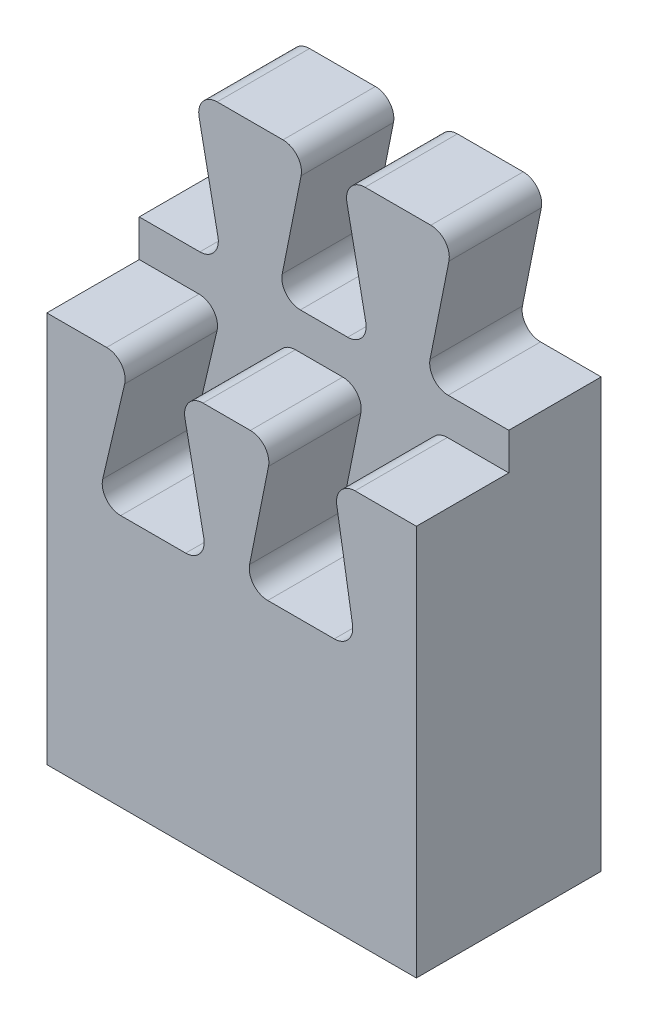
ISO-10303-21;
HEADER;
FILE_DESCRIPTION(('STEP AP214'),'2;1');
FILE_NAME('part.step','',(''),(''),'','','');
FILE_SCHEMA(('AUTOMOTIVE_DESIGN { 1 0 10303 214 1 1 1 1 }'));
ENDSEC;
DATA;
#1=APPLICATION_CONTEXT('core data for automotive mechanical design processes');
#2=APPLICATION_PROTOCOL_DEFINITION('international standard','automotive_design',2000,#1);
#3=PRODUCT_CONTEXT('',#1,'mechanical');
#4=PRODUCT('Part','Part','',(#3));
#5=PRODUCT_RELATED_PRODUCT_CATEGORY('part','',(#4));
#6=PRODUCT_DEFINITION_FORMATION('','',#4);
#7=PRODUCT_DEFINITION_CONTEXT('part definition',#1,'design');
#8=PRODUCT_DEFINITION('design','',#6,#7);
#9=PRODUCT_DEFINITION_SHAPE('','',#8);
#10=(LENGTH_UNIT() NAMED_UNIT(*) SI_UNIT(.MILLI.,.METRE.));
#11=(NAMED_UNIT(*) PLANE_ANGLE_UNIT() SI_UNIT($,.RADIAN.));
#12=(NAMED_UNIT(*) SI_UNIT($,.STERADIAN.) SOLID_ANGLE_UNIT());
#13=UNCERTAINTY_MEASURE_WITH_UNIT(LENGTH_MEASURE(1.E-05),#10,'distance_accuracy_value','');
#14=(GEOMETRIC_REPRESENTATION_CONTEXT(3) GLOBAL_UNCERTAINTY_ASSIGNED_CONTEXT((#13)) GLOBAL_UNIT_ASSIGNED_CONTEXT((#10,
#11,#12)) REPRESENTATION_CONTEXT('',''));
#15=CARTESIAN_POINT('',(0.,0.,0.));
#16=DIRECTION('',(0.,0.,1.));
#17=DIRECTION('',(1.,0.,0.));
#18=AXIS2_PLACEMENT_3D('',#15,#16,#17);
#19=CARTESIAN_POINT('',(2.76607840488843,36.6112155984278,5.));
#20=DIRECTION('',(-0.98058067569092,-0.196116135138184,0.));
#21=DIRECTION('',(0.196116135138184,-0.98058067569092,0.));
#22=AXIS2_PLACEMENT_3D('',#19,#20,#21);
#23=PLANE('',#22);
#24=DIRECTION('',(-0.196116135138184,0.98058067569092,0.));
#25=VECTOR('',#24,1.);
#26=CARTESIAN_POINT('',(2.76607840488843,36.6112155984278,0.));
#27=LINE('',#26,#25);
#28=CARTESIAN_POINT('',(2.5268551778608,37.8073317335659,0.));
#29=VERTEX_POINT('',#28);
#30=CARTESIAN_POINT('',(1.50530163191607,42.9150994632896,0.));
#31=VERTEX_POINT('',#30);
#32=EDGE_CURVE('E310',#29,#31,#27,.T.);
#33=ORIENTED_EDGE('',*,*,#32,.F.);
#34=DIRECTION('',(0.,0.,-1.));
#35=VECTOR('',#34,1.);
#36=CARTESIAN_POINT('',(2.5268551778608,37.8073317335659,5.));
#37=LINE('',#36,#35);
#38=CARTESIAN_POINT('',(2.5268551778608,37.8073317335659,5.));
#39=VERTEX_POINT('',#38);
#40=EDGE_CURVE('E518',#29,#39,#37,.F.);
#41=ORIENTED_EDGE('',*,*,#40,.T.);
#42=DIRECTION('',(-0.196116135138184,0.98058067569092,0.));
#43=VECTOR('',#42,1.);
#44=CARTESIAN_POINT('',(2.76607840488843,36.6112155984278,5.));
#45=LINE('',#44,#43);
#46=CARTESIAN_POINT('',(1.50530163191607,42.9150994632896,5.));
#47=VERTEX_POINT('',#46);
#48=EDGE_CURVE('E338',#39,#47,#45,.T.);
#49=ORIENTED_EDGE('',*,*,#48,.T.);
#50=DIRECTION('',(0.,0.,-1.));
#51=VECTOR('',#50,1.);
#52=CARTESIAN_POINT('',(1.50530163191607,42.9150994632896,5.));
#53=LINE('',#52,#51);
#54=EDGE_CURVE('E522',#47,#31,#53,.T.);
#55=ORIENTED_EDGE('',*,*,#54,.T.);
#56=EDGE_LOOP('',(#33,#41,#49,#55));
#57=FACE_BOUND('',#56,.T.);
#58=ADVANCED_FACE('F33',(#57),#23,.T.);
#59=CARTESIAN_POINT('',(-1.73392159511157,36.6112155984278,5.));
#60=DIRECTION('',(0.,1.,0.));
#61=DIRECTION('',(0.,0.,1.));
#62=AXIS2_PLACEMENT_3D('',#59,#60,#61);
#63=PLANE('',#62);
#64=DIRECTION('',(1.,0.,0.));
#65=VECTOR('',#64,1.);
#66=CARTESIAN_POINT('',(-1.73392159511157,36.6112155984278,5.));
#67=LINE('',#66,#65);
#68=CARTESIAN_POINT('',(-1.73392159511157,36.6112155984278,5.));
#69=VERTEX_POINT('',#68);
#70=CARTESIAN_POINT('',(1.54627450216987,36.6112155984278,5.));
#71=VERTEX_POINT('',#70);
#72=EDGE_CURVE('E591',#69,#71,#67,.T.);
#73=ORIENTED_EDGE('',*,*,#72,.T.);
#74=DIRECTION('',(0.,0.,-1.));
#75=VECTOR('',#74,1.);
#76=CARTESIAN_POINT('',(1.54627450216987,36.6112155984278,0.));
#77=LINE('',#76,#75);
#78=CARTESIAN_POINT('',(1.54627450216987,36.6112155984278,0.));
#79=VERTEX_POINT('',#78);
#80=EDGE_CURVE('E575',#71,#79,#77,.T.);
#81=ORIENTED_EDGE('',*,*,#80,.T.);
#82=DIRECTION('',(1.,0.,0.));
#83=VECTOR('',#82,1.);
#84=CARTESIAN_POINT('',(-1.73392159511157,36.6112155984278,0.));
#85=LINE('',#84,#83);
#86=CARTESIAN_POINT('',(-1.73392159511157,36.6112155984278,0.));
#87=VERTEX_POINT('',#86);
#88=EDGE_CURVE('E342',#87,#79,#85,.T.);
#89=ORIENTED_EDGE('',*,*,#88,.F.);
#90=DIRECTION('',(0.,0.,-1.));
#91=VECTOR('',#90,1.);
#92=CARTESIAN_POINT('',(-1.73392159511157,36.6112155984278,5.));
#93=LINE('',#92,#91);
#94=EDGE_CURVE('E324',#69,#87,#93,.T.);
#95=ORIENTED_EDGE('',*,*,#94,.F.);
#96=EDGE_LOOP('',(#73,#81,#89,#95));
#97=FACE_BOUND('',#96,.T.);
#98=ADVANCED_FACE('F695',(#97),#63,.T.);
#99=CARTESIAN_POINT('',(-1.73392159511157,36.6112155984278,5.));
#100=DIRECTION('',(1.,0.,0.));
#101=DIRECTION('',(0.,0.,-1.));
#102=AXIS2_PLACEMENT_3D('',#99,#100,#101);
#103=PLANE('',#102);
#104=DIRECTION('',(0.,-1.,0.));
#105=VECTOR('',#104,1.);
#106=CARTESIAN_POINT('',(-1.73392159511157,36.6112155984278,0.));
#107=LINE('',#106,#105);
#108=CARTESIAN_POINT('',(-1.73392159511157,13.4394595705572,0.));
#109=VERTEX_POINT('',#108);
#110=EDGE_CURVE('E607',#87,#109,#107,.T.);
#111=ORIENTED_EDGE('',*,*,#110,.T.);
#112=DIRECTION('',(0.,0.,-1.));
#113=VECTOR('',#112,1.);
#114=CARTESIAN_POINT('',(-1.73392159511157,13.4394595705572,5.));
#115=LINE('',#114,#113);
#116=CARTESIAN_POINT('',(-1.73392159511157,13.4394595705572,10.));
#117=VERTEX_POINT('',#116);
#118=EDGE_CURVE('E611',#117,#109,#115,.T.);
#119=ORIENTED_EDGE('',*,*,#118,.F.);
#120=DIRECTION('',(0.,-1.,0.));
#121=VECTOR('',#120,1.);
#122=CARTESIAN_POINT('',(-1.73392159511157,34.6112155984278,10.));
#123=LINE('',#122,#121);
#124=CARTESIAN_POINT('',(-1.73392159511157,34.6112155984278,10.));
#125=VERTEX_POINT('',#124);
#126=EDGE_CURVE('E313',#125,#117,#123,.T.);
#127=ORIENTED_EDGE('',*,*,#126,.F.);
#128=DIRECTION('',(0.,0.,-1.));
#129=VECTOR('',#128,1.);
#130=CARTESIAN_POINT('',(-1.73392159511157,34.6112155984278,10.));
#131=LINE('',#130,#129);
#132=CARTESIAN_POINT('',(-1.73392159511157,34.6112155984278,5.));
#133=VERTEX_POINT('',#132);
#134=EDGE_CURVE('E307',#125,#133,#131,.T.);
#135=ORIENTED_EDGE('',*,*,#134,.T.);
#136=DIRECTION('',(0.,-1.,0.));
#137=VECTOR('',#136,1.);
#138=CARTESIAN_POINT('',(-1.73392159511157,36.6112155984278,5.));
#139=LINE('',#138,#137);
#140=EDGE_CURVE('E368',#69,#133,#139,.T.);
#141=ORIENTED_EDGE('',*,*,#140,.F.);
#142=ORIENTED_EDGE('',*,*,#94,.T.);
#143=EDGE_LOOP('',(#111,#119,#127,#135,#141,#142));
#144=FACE_BOUND('',#143,.T.);
#145=ADVANCED_FACE('F625',(#144),#103,.F.);
#146=CARTESIAN_POINT('',(-1.73392159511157,13.4394595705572,5.));
#147=DIRECTION('',(0.,1.,0.));
#148=DIRECTION('',(0.,0.,1.));
#149=AXIS2_PLACEMENT_3D('',#146,#147,#148);
#150=PLANE('',#149);
#151=DIRECTION('',(1.,0.,0.));
#152=VECTOR('',#151,1.);
#153=CARTESIAN_POINT('',(-1.73392159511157,13.4394595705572,0.));
#154=LINE('',#153,#152);
#155=CARTESIAN_POINT('',(18.2660784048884,13.4394595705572,0.));
#156=VERTEX_POINT('',#155);
#157=EDGE_CURVE('E605',#109,#156,#154,.T.);
#158=ORIENTED_EDGE('',*,*,#157,.T.);
#159=DIRECTION('',(0.,0.,-1.));
#160=VECTOR('',#159,1.);
#161=CARTESIAN_POINT('',(18.2660784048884,13.4394595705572,5.));
#162=LINE('',#161,#160);
#163=CARTESIAN_POINT('',(18.2660784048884,13.4394595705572,10.));
#164=VERTEX_POINT('',#163);
#165=EDGE_CURVE('E614',#164,#156,#162,.T.);
#166=ORIENTED_EDGE('',*,*,#165,.F.);
#167=DIRECTION('',(1.,0.,0.));
#168=VECTOR('',#167,1.);
#169=CARTESIAN_POINT('',(-1.73392159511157,13.4394595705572,10.));
#170=LINE('',#169,#168);
#171=EDGE_CURVE('E298',#117,#164,#170,.T.);
#172=ORIENTED_EDGE('',*,*,#171,.F.);
#173=ORIENTED_EDGE('',*,*,#118,.T.);
#174=EDGE_LOOP('',(#158,#166,#172,#173));
#175=FACE_BOUND('',#174,.T.);
#176=ADVANCED_FACE('F1011',(#175),#150,.F.);
#177=CARTESIAN_POINT('',(18.2660784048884,13.4394595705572,5.));
#178=DIRECTION('',(-1.,0.,0.));
#179=DIRECTION('',(0.,0.,1.));
#180=AXIS2_PLACEMENT_3D('',#177,#178,#179);
#181=PLANE('',#180);
#182=DIRECTION('',(0.,1.,0.));
#183=VECTOR('',#182,1.);
#184=CARTESIAN_POINT('',(18.2660784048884,13.4394595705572,0.));
#185=LINE('',#184,#183);
#186=CARTESIAN_POINT('',(18.2660784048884,36.6112155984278,0.));
#187=VERTEX_POINT('',#186);
#188=EDGE_CURVE('E603',#156,#187,#185,.T.);
#189=ORIENTED_EDGE('',*,*,#188,.T.);
#190=DIRECTION('',(0.,0.,-1.));
#191=VECTOR('',#190,1.);
#192=CARTESIAN_POINT('',(18.2660784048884,36.6112155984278,5.));
#193=LINE('',#192,#191);
#194=CARTESIAN_POINT('',(18.2660784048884,36.6112155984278,5.));
#195=VERTEX_POINT('',#194);
#196=EDGE_CURVE('E615',#195,#187,#193,.T.);
#197=ORIENTED_EDGE('',*,*,#196,.F.);
#198=DIRECTION('',(0.,1.,0.));
#199=VECTOR('',#198,1.);
#200=CARTESIAN_POINT('',(18.2660784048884,13.4394595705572,5.));
#201=LINE('',#200,#199);
#202=CARTESIAN_POINT('',(18.2660784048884,34.6112155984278,5.));
#203=VERTEX_POINT('',#202);
#204=EDGE_CURVE('E306',#203,#195,#201,.T.);
#205=ORIENTED_EDGE('',*,*,#204,.F.);
#206=DIRECTION('',(0.,0.,-1.));
#207=VECTOR('',#206,1.);
#208=CARTESIAN_POINT('',(18.2660784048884,34.6112155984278,10.));
#209=LINE('',#208,#207);
#210=CARTESIAN_POINT('',(18.2660784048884,34.6112155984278,10.));
#211=VERTEX_POINT('',#210);
#212=EDGE_CURVE('E283',#211,#203,#209,.T.);
#213=ORIENTED_EDGE('',*,*,#212,.F.);
#214=DIRECTION('',(0.,1.,0.));
#215=VECTOR('',#214,1.);
#216=CARTESIAN_POINT('',(18.2660784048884,13.4394595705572,10.));
#217=LINE('',#216,#215);
#218=EDGE_CURVE('E289',#164,#211,#217,.T.);
#219=ORIENTED_EDGE('',*,*,#218,.F.);
#220=ORIENTED_EDGE('',*,*,#165,.T.);
#221=EDGE_LOOP('',(#189,#197,#205,#213,#219,#220));
#222=FACE_BOUND('',#221,.T.);
#223=ADVANCED_FACE('F303',(#222),#181,.F.);
#224=CARTESIAN_POINT('',(13.7660784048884,36.6112155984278,5.));
#225=DIRECTION('',(0.,1.,0.));
#226=DIRECTION('',(0.,0.,1.));
#227=AXIS2_PLACEMENT_3D('',#224,#225,#226);
#228=PLANE('',#227);
#229=DIRECTION('',(1.,0.,0.));
#230=VECTOR('',#229,1.);
#231=CARTESIAN_POINT('',(13.7660784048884,36.6112155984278,0.));
#232=LINE('',#231,#230);
#233=CARTESIAN_POINT('',(14.985882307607,36.6112155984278,0.));
#234=VERTEX_POINT('',#233);
#235=EDGE_CURVE('E601',#234,#187,#232,.T.);
#236=ORIENTED_EDGE('',*,*,#235,.F.);
#237=DIRECTION('',(0.,0.,-1.));
#238=VECTOR('',#237,1.);
#239=CARTESIAN_POINT('',(14.985882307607,36.6112155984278,5.));
#240=LINE('',#239,#238);
#241=CARTESIAN_POINT('',(14.985882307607,36.6112155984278,5.));
#242=VERTEX_POINT('',#241);
#243=EDGE_CURVE('E454',#234,#242,#240,.F.);
#244=ORIENTED_EDGE('',*,*,#243,.T.);
#245=DIRECTION('',(1.,0.,0.));
#246=VECTOR('',#245,1.);
#247=CARTESIAN_POINT('',(13.7660784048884,36.6112155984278,5.));
#248=LINE('',#247,#246);
#249=EDGE_CURVE('E360',#242,#195,#248,.T.);
#250=ORIENTED_EDGE('',*,*,#249,.T.);
#251=ORIENTED_EDGE('',*,*,#196,.T.);
#252=EDGE_LOOP('',(#236,#244,#250,#251));
#253=FACE_BOUND('',#252,.T.);
#254=ADVANCED_FACE('F981',(#253),#228,.T.);
#255=CARTESIAN_POINT('',(15.2660784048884,44.1112155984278,5.));
#256=DIRECTION('',(0.98058067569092,-0.196116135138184,0.));
#257=DIRECTION('',(0.196116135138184,0.98058067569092,0.));
#258=AXIS2_PLACEMENT_3D('',#255,#256,#257);
#259=PLANE('',#258);
#260=DIRECTION('',(-0.196116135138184,-0.98058067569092,0.));
#261=VECTOR('',#260,1.);
#262=CARTESIAN_POINT('',(15.2660784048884,44.1112155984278,5.));
#263=LINE('',#262,#261);
#264=CARTESIAN_POINT('',(15.0268551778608,42.9150994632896,5.));
#265=VERTEX_POINT('',#264);
#266=CARTESIAN_POINT('',(14.0053016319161,37.8073317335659,5.));
#267=VERTEX_POINT('',#266);
#268=EDGE_CURVE('E357',#265,#267,#263,.T.);
#269=ORIENTED_EDGE('',*,*,#268,.T.);
#270=DIRECTION('',(0.,0.,-1.));
#271=VECTOR('',#270,1.);
#272=CARTESIAN_POINT('',(14.0053016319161,37.8073317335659,0.));
#273=LINE('',#272,#271);
#274=CARTESIAN_POINT('',(14.0053016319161,37.8073317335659,0.));
#275=VERTEX_POINT('',#274);
#276=EDGE_CURVE('E451',#267,#275,#273,.T.);
#277=ORIENTED_EDGE('',*,*,#276,.T.);
#278=DIRECTION('',(-0.196116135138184,-0.98058067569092,0.));
#279=VECTOR('',#278,1.);
#280=CARTESIAN_POINT('',(15.2660784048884,44.1112155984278,0.));
#281=LINE('',#280,#279);
#282=CARTESIAN_POINT('',(15.0268551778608,42.9150994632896,0.));
#283=VERTEX_POINT('',#282);
#284=EDGE_CURVE('E598',#283,#275,#281,.T.);
#285=ORIENTED_EDGE('',*,*,#284,.F.);
#286=DIRECTION('',(0.,0.,-1.));
#287=VECTOR('',#286,1.);
#288=CARTESIAN_POINT('',(15.0268551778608,42.9150994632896,5.));
#289=LINE('',#288,#287);
#290=EDGE_CURVE('E449',#283,#265,#289,.F.);
#291=ORIENTED_EDGE('',*,*,#290,.T.);
#292=EDGE_LOOP('',(#269,#277,#285,#291));
#293=FACE_BOUND('',#292,.T.);
#294=ADVANCED_FACE('F971',(#293),#259,.T.);
#295=CARTESIAN_POINT('',(9.26607840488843,44.1112155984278,5.));
#296=DIRECTION('',(0.,1.,0.));
#297=DIRECTION('',(0.,0.,1.));
#298=AXIS2_PLACEMENT_3D('',#295,#296,#297);
#299=PLANE('',#298);
#300=DIRECTION('',(1.,0.,0.));
#301=VECTOR('',#300,1.);
#302=CARTESIAN_POINT('',(9.26607840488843,44.1112155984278,5.));
#303=LINE('',#302,#301);
#304=CARTESIAN_POINT('',(10.485882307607,44.1112155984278,5.));
#305=VERTEX_POINT('',#304);
#306=CARTESIAN_POINT('',(14.0462745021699,44.1112155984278,5.));
#307=VERTEX_POINT('',#306);
#308=EDGE_CURVE('E354',#305,#307,#303,.T.);
#309=ORIENTED_EDGE('',*,*,#308,.T.);
#310=DIRECTION('',(0.,0.,-1.));
#311=VECTOR('',#310,1.);
#312=CARTESIAN_POINT('',(14.0462745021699,44.1112155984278,5.));
#313=LINE('',#312,#311);
#314=CARTESIAN_POINT('',(14.0462745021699,44.1112155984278,0.));
#315=VERTEX_POINT('',#314);
#316=EDGE_CURVE('E458',#307,#315,#313,.T.);
#317=ORIENTED_EDGE('',*,*,#316,.T.);
#318=DIRECTION('',(1.,0.,0.));
#319=VECTOR('',#318,1.);
#320=CARTESIAN_POINT('',(9.26607840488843,44.1112155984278,0.));
#321=LINE('',#320,#319);
#322=CARTESIAN_POINT('',(10.485882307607,44.1112155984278,0.));
#323=VERTEX_POINT('',#322);
#324=EDGE_CURVE('E596',#323,#315,#321,.T.);
#325=ORIENTED_EDGE('',*,*,#324,.F.);
#326=DIRECTION('',(0.,0.,-1.));
#327=VECTOR('',#326,1.);
#328=CARTESIAN_POINT('',(10.485882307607,44.1112155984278,5.));
#329=LINE('',#328,#327);
#330=EDGE_CURVE('E456',#323,#305,#329,.F.);
#331=ORIENTED_EDGE('',*,*,#330,.T.);
#332=EDGE_LOOP('',(#309,#317,#325,#331));
#333=FACE_BOUND('',#332,.T.);
#334=ADVANCED_FACE('F961',(#333),#299,.T.);
#335=CARTESIAN_POINT('',(10.7660784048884,36.6112155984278,5.));
#336=DIRECTION('',(-0.98058067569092,-0.196116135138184,0.));
#337=DIRECTION('',(0.196116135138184,-0.98058067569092,0.));
#338=AXIS2_PLACEMENT_3D('',#335,#336,#337);
#339=PLANE('',#338);
#340=DIRECTION('',(-0.196116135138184,0.98058067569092,0.));
#341=VECTOR('',#340,1.);
#342=CARTESIAN_POINT('',(10.7660784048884,36.6112155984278,0.));
#343=LINE('',#342,#341);
#344=CARTESIAN_POINT('',(10.5268551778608,37.8073317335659,0.));
#345=VERTEX_POINT('',#344);
#346=CARTESIAN_POINT('',(9.50530163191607,42.9150994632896,0.));
#347=VERTEX_POINT('',#346);
#348=EDGE_CURVE('E515',#345,#347,#343,.T.);
#349=ORIENTED_EDGE('',*,*,#348,.F.);
#350=DIRECTION('',(0.,0.,-1.));
#351=VECTOR('',#350,1.);
#352=CARTESIAN_POINT('',(10.5268551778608,37.8073317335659,5.));
#353=LINE('',#352,#351);
#354=CARTESIAN_POINT('',(10.5268551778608,37.8073317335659,5.));
#355=VERTEX_POINT('',#354);
#356=EDGE_CURVE('E528',#345,#355,#353,.F.);
#357=ORIENTED_EDGE('',*,*,#356,.T.);
#358=DIRECTION('',(-0.196116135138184,0.98058067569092,0.));
#359=VECTOR('',#358,1.);
#360=CARTESIAN_POINT('',(10.7660784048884,36.6112155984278,5.));
#361=LINE('',#360,#359);
#362=CARTESIAN_POINT('',(9.50530163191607,42.9150994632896,5.));
#363=VERTEX_POINT('',#362);
#364=EDGE_CURVE('E351',#355,#363,#361,.T.);
#365=ORIENTED_EDGE('',*,*,#364,.T.);
#366=DIRECTION('',(0.,0.,-1.));
#367=VECTOR('',#366,1.);
#368=CARTESIAN_POINT('',(9.50530163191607,42.9150994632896,5.));
#369=LINE('',#368,#367);
#370=EDGE_CURVE('E520',#363,#347,#369,.T.);
#371=ORIENTED_EDGE('',*,*,#370,.T.);
#372=EDGE_LOOP('',(#349,#357,#365,#371));
#373=FACE_BOUND('',#372,.T.);
#374=ADVANCED_FACE('F692',(#373),#339,.T.);
#375=CARTESIAN_POINT('',(5.76607840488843,36.6112155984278,5.));
#376=DIRECTION('',(0.,1.,0.));
#377=DIRECTION('',(0.,0.,1.));
#378=AXIS2_PLACEMENT_3D('',#375,#376,#377);
#379=PLANE('',#378);
#380=DIRECTION('',(1.,0.,0.));
#381=VECTOR('',#380,1.);
#382=CARTESIAN_POINT('',(5.76607840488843,36.6112155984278,5.));
#383=LINE('',#382,#381);
#384=CARTESIAN_POINT('',(6.98588230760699,36.6112155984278,5.));
#385=VERTEX_POINT('',#384);
#386=CARTESIAN_POINT('',(9.54627450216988,36.6112155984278,5.));
#387=VERTEX_POINT('',#386);
#388=EDGE_CURVE('E348',#385,#387,#383,.T.);
#389=ORIENTED_EDGE('',*,*,#388,.T.);
#390=DIRECTION('',(0.,0.,-1.));
#391=VECTOR('',#390,1.);
#392=CARTESIAN_POINT('',(9.54627450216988,36.6112155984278,0.));
#393=LINE('',#392,#391);
#394=CARTESIAN_POINT('',(9.54627450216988,36.6112155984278,0.));
#395=VERTEX_POINT('',#394);
#396=EDGE_CURVE('E514',#387,#395,#393,.T.);
#397=ORIENTED_EDGE('',*,*,#396,.T.);
#398=DIRECTION('',(1.,0.,0.));
#399=VECTOR('',#398,1.);
#400=CARTESIAN_POINT('',(5.76607840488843,36.6112155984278,0.));
#401=LINE('',#400,#399);
#402=CARTESIAN_POINT('',(6.98588230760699,36.6112155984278,0.));
#403=VERTEX_POINT('',#402);
#404=EDGE_CURVE('E506',#403,#395,#401,.T.);
#405=ORIENTED_EDGE('',*,*,#404,.F.);
#406=DIRECTION('',(0.,0.,-1.));
#407=VECTOR('',#406,1.);
#408=CARTESIAN_POINT('',(6.98588230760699,36.6112155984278,5.));
#409=LINE('',#408,#407);
#410=EDGE_CURVE('E511',#403,#385,#409,.F.);
#411=ORIENTED_EDGE('',*,*,#410,.T.);
#412=EDGE_LOOP('',(#389,#397,#405,#411));
#413=FACE_BOUND('',#412,.T.);
#414=ADVANCED_FACE('F510',(#413),#379,.T.);
#415=CARTESIAN_POINT('',(7.26607840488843,44.1112155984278,5.));
#416=DIRECTION('',(0.98058067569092,-0.196116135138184,0.));
#417=DIRECTION('',(0.196116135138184,0.98058067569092,0.));
#418=AXIS2_PLACEMENT_3D('',#415,#416,#417);
#419=PLANE('',#418);
#420=DIRECTION('',(-0.196116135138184,-0.98058067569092,0.));
#421=VECTOR('',#420,1.);
#422=CARTESIAN_POINT('',(7.26607840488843,44.1112155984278,0.));
#423=LINE('',#422,#421);
#424=CARTESIAN_POINT('',(7.0268551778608,42.9150994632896,0.));
#425=VERTEX_POINT('',#424);
#426=CARTESIAN_POINT('',(6.00530163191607,37.8073317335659,0.));
#427=VERTEX_POINT('',#426);
#428=EDGE_CURVE('E507',#425,#427,#423,.T.);
#429=ORIENTED_EDGE('',*,*,#428,.F.);
#430=DIRECTION('',(0.,0.,-1.));
#431=VECTOR('',#430,1.);
#432=CARTESIAN_POINT('',(7.0268551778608,42.9150994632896,5.));
#433=LINE('',#432,#431);
#434=CARTESIAN_POINT('',(7.0268551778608,42.9150994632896,5.));
#435=VERTEX_POINT('',#434);
#436=EDGE_CURVE('E475',#425,#435,#433,.F.);
#437=ORIENTED_EDGE('',*,*,#436,.T.);
#438=DIRECTION('',(-0.196116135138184,-0.98058067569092,0.));
#439=VECTOR('',#438,1.);
#440=CARTESIAN_POINT('',(7.26607840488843,44.1112155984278,5.));
#441=LINE('',#440,#439);
#442=CARTESIAN_POINT('',(6.00530163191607,37.8073317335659,5.));
#443=VERTEX_POINT('',#442);
#444=EDGE_CURVE('E345',#435,#443,#441,.T.);
#445=ORIENTED_EDGE('',*,*,#444,.T.);
#446=DIRECTION('',(0.,0.,-1.));
#447=VECTOR('',#446,1.);
#448=CARTESIAN_POINT('',(6.00530163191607,37.8073317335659,0.));
#449=LINE('',#448,#447);
#450=EDGE_CURVE('E473',#443,#427,#449,.T.);
#451=ORIENTED_EDGE('',*,*,#450,.T.);
#452=EDGE_LOOP('',(#429,#437,#445,#451));
#453=FACE_BOUND('',#452,.T.);
#454=ADVANCED_FACE('F684',(#453),#419,.T.);
#455=CARTESIAN_POINT('',(1.26607840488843,44.1112155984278,5.));
#456=DIRECTION('',(0.,1.,0.));
#457=DIRECTION('',(0.,0.,1.));
#458=AXIS2_PLACEMENT_3D('',#455,#456,#457);
#459=PLANE('',#458);
#460=DIRECTION('',(1.,0.,0.));
#461=VECTOR('',#460,1.);
#462=CARTESIAN_POINT('',(1.26607840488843,44.1112155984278,0.));
#463=LINE('',#462,#461);
#464=CARTESIAN_POINT('',(2.48588230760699,44.1112155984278,0.));
#465=VERTEX_POINT('',#464);
#466=CARTESIAN_POINT('',(6.04627450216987,44.1112155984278,0.));
#467=VERTEX_POINT('',#466);
#468=EDGE_CURVE('E588',#465,#467,#463,.T.);
#469=ORIENTED_EDGE('',*,*,#468,.F.);
#470=DIRECTION('',(0.,0.,-1.));
#471=VECTOR('',#470,1.);
#472=CARTESIAN_POINT('',(2.48588230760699,44.1112155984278,5.));
#473=LINE('',#472,#471);
#474=CARTESIAN_POINT('',(2.48588230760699,44.1112155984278,5.));
#475=VERTEX_POINT('',#474);
#476=EDGE_CURVE('E471',#465,#475,#473,.F.);
#477=ORIENTED_EDGE('',*,*,#476,.T.);
#478=DIRECTION('',(1.,0.,0.));
#479=VECTOR('',#478,1.);
#480=CARTESIAN_POINT('',(1.26607840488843,44.1112155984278,5.));
#481=LINE('',#480,#479);
#482=CARTESIAN_POINT('',(6.04627450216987,44.1112155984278,5.));
#483=VERTEX_POINT('',#482);
#484=EDGE_CURVE('E341',#475,#483,#481,.T.);
#485=ORIENTED_EDGE('',*,*,#484,.T.);
#486=DIRECTION('',(0.,0.,-1.));
#487=VECTOR('',#486,1.);
#488=CARTESIAN_POINT('',(6.04627450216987,44.1112155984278,5.));
#489=LINE('',#488,#487);
#490=EDGE_CURVE('E468',#483,#467,#489,.T.);
#491=ORIENTED_EDGE('',*,*,#490,.T.);
#492=EDGE_LOOP('',(#469,#477,#485,#491));
#493=FACE_BOUND('',#492,.T.);
#494=ADVANCED_FACE('F680',(#493),#459,.T.);
#495=CARTESIAN_POINT('',(0.,0.,5.));
#496=DIRECTION('',(0.,0.,-1.));
#497=DIRECTION('',(-1.,0.,0.));
#498=AXIS2_PLACEMENT_3D('',#495,#496,#497);
#499=PLANE('',#498);
#500=DIRECTION('',(-0.229095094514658,-0.973404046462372,0.));
#501=VECTOR('',#500,1.);
#502=CARTESIAN_POINT('',(2.76607840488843,34.6112155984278,5.));
#503=LINE('',#502,#501);
#504=CARTESIAN_POINT('',(2.47680525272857,33.3821205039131,5.));
#505=VERTEX_POINT('',#504);
#506=CARTESIAN_POINT('',(1.29019225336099,28.3403106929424,5.));
#507=VERTEX_POINT('',#506);
#508=EDGE_CURVE('E402',#505,#507,#503,.T.);
#509=ORIENTED_EDGE('',*,*,#508,.T.);
#510=CARTESIAN_POINT('',(2.26359629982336,28.1112155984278,5.));
#511=DIRECTION('',(0.,0.,-1.));
#512=DIRECTION('',(-1.,0.,0.));
#513=AXIS2_PLACEMENT_3D('',#510,#511,#512);
#514=CIRCLE('',#513,1.);
#515=CARTESIAN_POINT('',(2.26359629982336,27.1112155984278,5.));
#516=VERTEX_POINT('',#515);
#517=EDGE_CURVE('E642',#507,#516,#514,.F.);
#518=ORIENTED_EDGE('',*,*,#517,.T.);
#519=DIRECTION('',(1.,0.,0.));
#520=VECTOR('',#519,1.);
#521=CARTESIAN_POINT('',(1.00091910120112,27.1112155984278,5.));
#522=LINE('',#521,#520);
#523=CARTESIAN_POINT('',(5.78111519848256,27.1112155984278,5.));
#524=VERTEX_POINT('',#523);
#525=EDGE_CURVE('E405',#516,#524,#522,.T.);
#526=ORIENTED_EDGE('',*,*,#525,.T.);
#527=CARTESIAN_POINT('',(5.78111519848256,28.1112155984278,5.));
#528=DIRECTION('',(0.,0.,-1.));
#529=DIRECTION('',(-1.,0.,0.));
#530=AXIS2_PLACEMENT_3D('',#527,#528,#529);
#531=CIRCLE('',#530,1.);
#532=CARTESIAN_POINT('',(6.76169587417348,28.3073317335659,5.));
#533=VERTEX_POINT('',#532);
#534=EDGE_CURVE('E649',#524,#533,#531,.F.);
#535=ORIENTED_EDGE('',*,*,#534,.T.);
#536=DIRECTION('',(-0.196116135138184,0.98058067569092,0.));
#537=VECTOR('',#536,1.);
#538=CARTESIAN_POINT('',(7.00091910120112,27.1112155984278,5.));
#539=LINE('',#538,#537);
#540=CARTESIAN_POINT('',(5.74014232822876,33.4150994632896,5.));
#541=VERTEX_POINT('',#540);
#542=EDGE_CURVE('E408',#533,#541,#539,.T.);
#543=ORIENTED_EDGE('',*,*,#542,.T.);
#544=CARTESIAN_POINT('',(6.72072300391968,33.6112155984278,5.));
#545=DIRECTION('',(0.,0.,-1.));
#546=DIRECTION('',(-1.,0.,0.));
#547=AXIS2_PLACEMENT_3D('',#544,#545,#546);
#548=CIRCLE('',#547,1.);
#549=CARTESIAN_POINT('',(6.72072300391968,34.6112155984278,5.));
#550=VERTEX_POINT('',#549);
#551=EDGE_CURVE('E479',#541,#550,#548,.T.);
#552=ORIENTED_EDGE('',*,*,#551,.T.);
#553=DIRECTION('',(1.,0.,0.));
#554=VECTOR('',#553,1.);
#555=CARTESIAN_POINT('',(5.50091910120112,34.6112155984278,5.));
#556=LINE('',#555,#554);
#557=CARTESIAN_POINT('',(9.28111519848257,34.6112155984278,5.));
#558=VERTEX_POINT('',#557);
#559=EDGE_CURVE('E411',#550,#558,#556,.T.);
#560=ORIENTED_EDGE('',*,*,#559,.T.);
#561=CARTESIAN_POINT('',(9.28111519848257,33.6112155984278,5.));
#562=DIRECTION('',(0.,0.,-1.));
#563=DIRECTION('',(-1.,0.,0.));
#564=AXIS2_PLACEMENT_3D('',#561,#562,#563);
#565=CIRCLE('',#564,1.);
#566=CARTESIAN_POINT('',(10.2616958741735,33.4150994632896,5.));
#567=VERTEX_POINT('',#566);
#568=EDGE_CURVE('E496',#558,#567,#565,.T.);
#569=ORIENTED_EDGE('',*,*,#568,.T.);
#570=DIRECTION('',(-0.196116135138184,-0.98058067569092,0.));
#571=VECTOR('',#570,1.);
#572=CARTESIAN_POINT('',(10.5009191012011,34.6112155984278,5.));
#573=LINE('',#572,#571);
#574=CARTESIAN_POINT('',(9.24014232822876,28.3073317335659,5.));
#575=VERTEX_POINT('',#574);
#576=EDGE_CURVE('E414',#567,#575,#573,.T.);
#577=ORIENTED_EDGE('',*,*,#576,.T.);
#578=CARTESIAN_POINT('',(10.2207230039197,28.1112155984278,5.));
#579=DIRECTION('',(0.,0.,-1.));
#580=DIRECTION('',(-1.,0.,0.));
#581=AXIS2_PLACEMENT_3D('',#578,#579,#580);
#582=CIRCLE('',#581,1.);
#583=CARTESIAN_POINT('',(10.2207230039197,27.1112155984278,5.));
#584=VERTEX_POINT('',#583);
#585=EDGE_CURVE('E540',#575,#584,#582,.F.);
#586=ORIENTED_EDGE('',*,*,#585,.T.);
#587=DIRECTION('',(1.,0.,0.));
#588=VECTOR('',#587,1.);
#589=CARTESIAN_POINT('',(9.00091910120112,27.1112155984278,5.));
#590=LINE('',#589,#588);
#591=CARTESIAN_POINT('',(13.8228102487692,27.1112155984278,5.));
#592=VERTEX_POINT('',#591);
#593=EDGE_CURVE('E416',#584,#592,#590,.T.);
#594=ORIENTED_EDGE('',*,*,#593,.T.);
#595=CARTESIAN_POINT('',(13.8228102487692,28.1112155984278,5.));
#596=DIRECTION('',(0.,0.,-1.));
#597=DIRECTION('',(-1.,0.,0.));
#598=AXIS2_PLACEMENT_3D('',#595,#596,#597);
#599=CIRCLE('',#598,1.);
#600=CARTESIAN_POINT('',(14.8095256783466,28.273673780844,5.));
#601=VERTEX_POINT('',#600);
#602=EDGE_CURVE('E423',#592,#601,#599,.F.);
#603=ORIENTED_EDGE('',*,*,#602,.T.);
#604=DIRECTION('',(-0.162458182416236,0.986715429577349,0.));
#605=VECTOR('',#604,1.);
#606=CARTESIAN_POINT('',(15.0009191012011,27.1112155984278,5.));
#607=LINE('',#606,#605);
#608=CARTESIAN_POINT('',(13.957471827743,33.4487574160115,5.));
#609=VERTEX_POINT('',#608);
#610=EDGE_CURVE('E332',#601,#609,#607,.T.);
#611=ORIENTED_EDGE('',*,*,#610,.T.);
#612=CARTESIAN_POINT('',(14.9441872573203,33.6112155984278,5.));
#613=DIRECTION('',(0.,0.,-1.));
#614=DIRECTION('',(-1.,0.,0.));
#615=AXIS2_PLACEMENT_3D('',#612,#613,#614);
#616=CIRCLE('',#615,1.);
#617=CARTESIAN_POINT('',(14.9441872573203,34.6112155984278,5.));
#618=VERTEX_POINT('',#617);
#619=EDGE_CURVE('E422',#609,#618,#616,.T.);
#620=ORIENTED_EDGE('',*,*,#619,.T.);
#621=DIRECTION('',(1.,0.,0.));
#622=VECTOR('',#621,1.);
#623=CARTESIAN_POINT('',(13.7660784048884,34.6112155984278,5.));
#624=LINE('',#623,#622);
#625=EDGE_CURVE('E328',#618,#203,#624,.T.);
#626=ORIENTED_EDGE('',*,*,#625,.T.);
#627=ORIENTED_EDGE('',*,*,#204,.T.);
#628=ORIENTED_EDGE('',*,*,#249,.F.);
#629=CARTESIAN_POINT('',(14.985882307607,37.6112155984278,5.));
#630=DIRECTION('',(0.,0.,-1.));
#631=DIRECTION('',(-1.,0.,0.));
#632=AXIS2_PLACEMENT_3D('',#629,#630,#631);
#633=CIRCLE('',#632,1.);
#634=EDGE_CURVE('E501',#242,#267,#633,.T.);
#635=ORIENTED_EDGE('',*,*,#634,.T.);
#636=ORIENTED_EDGE('',*,*,#268,.F.);
#637=CARTESIAN_POINT('',(14.0462745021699,43.1112155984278,5.));
#638=DIRECTION('',(0.,0.,-1.));
#639=DIRECTION('',(-1.,0.,0.));
#640=AXIS2_PLACEMENT_3D('',#637,#638,#639);
#641=CIRCLE('',#640,1.);
#642=EDGE_CURVE('E667',#265,#307,#641,.F.);
#643=ORIENTED_EDGE('',*,*,#642,.T.);
#644=ORIENTED_EDGE('',*,*,#308,.F.);
#645=CARTESIAN_POINT('',(10.485882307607,43.1112155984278,5.));
#646=DIRECTION('',(0.,0.,-1.));
#647=DIRECTION('',(-1.,0.,0.));
#648=AXIS2_PLACEMENT_3D('',#645,#646,#647);
#649=CIRCLE('',#648,1.);
#650=EDGE_CURVE('E671',#305,#363,#649,.F.);
#651=ORIENTED_EDGE('',*,*,#650,.T.);
#652=ORIENTED_EDGE('',*,*,#364,.F.);
#653=CARTESIAN_POINT('',(9.54627450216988,37.6112155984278,5.));
#654=DIRECTION('',(0.,0.,-1.));
#655=DIRECTION('',(-1.,0.,0.));
#656=AXIS2_PLACEMENT_3D('',#653,#654,#655);
#657=CIRCLE('',#656,1.);
#658=EDGE_CURVE('E489',#355,#387,#657,.T.);
#659=ORIENTED_EDGE('',*,*,#658,.T.);
#660=ORIENTED_EDGE('',*,*,#388,.F.);
#661=CARTESIAN_POINT('',(6.98588230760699,37.6112155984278,5.));
#662=DIRECTION('',(0.,0.,-1.));
#663=DIRECTION('',(-1.,0.,0.));
#664=AXIS2_PLACEMENT_3D('',#661,#662,#663);
#665=CIRCLE('',#664,1.);
#666=EDGE_CURVE('E11',#385,#443,#665,.T.);
#667=ORIENTED_EDGE('',*,*,#666,.T.);
#668=ORIENTED_EDGE('',*,*,#444,.F.);
#669=CARTESIAN_POINT('',(6.04627450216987,43.1112155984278,5.));
#670=DIRECTION('',(0.,0.,-1.));
#671=DIRECTION('',(-1.,0.,0.));
#672=AXIS2_PLACEMENT_3D('',#669,#670,#671);
#673=CIRCLE('',#672,1.);
#674=EDGE_CURVE('E327',#435,#483,#673,.F.);
#675=ORIENTED_EDGE('',*,*,#674,.T.);
#676=ORIENTED_EDGE('',*,*,#484,.F.);
#677=CARTESIAN_POINT('',(2.48588230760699,43.1112155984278,5.));
#678=DIRECTION('',(0.,0.,-1.));
#679=DIRECTION('',(-1.,0.,0.));
#680=AXIS2_PLACEMENT_3D('',#677,#678,#679);
#681=CIRCLE('',#680,1.);
#682=EDGE_CURVE('E672',#475,#47,#681,.F.);
#683=ORIENTED_EDGE('',*,*,#682,.T.);
#684=ORIENTED_EDGE('',*,*,#48,.F.);
#685=CARTESIAN_POINT('',(1.54627450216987,37.6112155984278,5.));
#686=DIRECTION('',(0.,0.,-1.));
#687=DIRECTION('',(-1.,0.,0.));
#688=AXIS2_PLACEMENT_3D('',#685,#686,#687);
#689=CIRCLE('',#688,1.);
#690=EDGE_CURVE('E485',#39,#71,#689,.T.);
#691=ORIENTED_EDGE('',*,*,#690,.T.);
#692=ORIENTED_EDGE('',*,*,#72,.F.);
#693=ORIENTED_EDGE('',*,*,#140,.T.);
#694=DIRECTION('',(1.,0.,0.));
#695=VECTOR('',#694,1.);
#696=CARTESIAN_POINT('',(-1.73392159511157,34.6112155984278,5.));
#697=LINE('',#696,#695);
#698=CARTESIAN_POINT('',(1.50340120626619,34.6112155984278,5.));
#699=VERTEX_POINT('',#698);
#700=EDGE_CURVE('E331',#133,#699,#697,.T.);
#701=ORIENTED_EDGE('',*,*,#700,.T.);
#702=CARTESIAN_POINT('',(1.50340120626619,33.6112155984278,5.));
#703=DIRECTION('',(0.,0.,-1.));
#704=DIRECTION('',(-1.,0.,0.));
#705=AXIS2_PLACEMENT_3D('',#702,#703,#704);
#706=CIRCLE('',#705,1.);
#707=EDGE_CURVE('E481',#699,#505,#706,.T.);
#708=ORIENTED_EDGE('',*,*,#707,.T.);
#709=EDGE_LOOP('',(#509,#518,#526,#535,#543,#552,#560,#569,#577,#586,#594,#603,#611,#620,#626,
#627,#628,#635,#636,#643,#644,#651,#652,#659,#660,#667,#668,#675,#676,#683,#684,#691,#692,#693,
#701,#708));
#710=FACE_BOUND('',#709,.T.);
#711=ADVANCED_FACE('F421',(#710),#499,.F.);
#712=CARTESIAN_POINT('',(0.,0.,0.));
#713=DIRECTION('',(0.,0.,-1.));
#714=DIRECTION('',(-1.,0.,0.));
#715=AXIS2_PLACEMENT_3D('',#712,#713,#714);
#716=PLANE('',#715);
#717=ORIENTED_EDGE('',*,*,#324,.T.);
#718=CARTESIAN_POINT('',(14.0462745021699,43.1112155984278,0.));
#719=DIRECTION('',(0.,0.,-1.));
#720=DIRECTION('',(-1.,0.,0.));
#721=AXIS2_PLACEMENT_3D('',#718,#719,#720);
#722=CIRCLE('',#721,1.);
#723=EDGE_CURVE('E466',#315,#283,#722,.T.);
#724=ORIENTED_EDGE('',*,*,#723,.T.);
#725=ORIENTED_EDGE('',*,*,#284,.T.);
#726=CARTESIAN_POINT('',(14.985882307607,37.6112155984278,0.));
#727=DIRECTION('',(0.,0.,-1.));
#728=DIRECTION('',(-1.,0.,0.));
#729=AXIS2_PLACEMENT_3D('',#726,#727,#728);
#730=CIRCLE('',#729,1.);
#731=EDGE_CURVE('E499',#275,#234,#730,.F.);
#732=ORIENTED_EDGE('',*,*,#731,.T.);
#733=ORIENTED_EDGE('',*,*,#235,.T.);
#734=ORIENTED_EDGE('',*,*,#188,.F.);
#735=ORIENTED_EDGE('',*,*,#157,.F.);
#736=ORIENTED_EDGE('',*,*,#110,.F.);
#737=ORIENTED_EDGE('',*,*,#88,.T.);
#738=CARTESIAN_POINT('',(1.54627450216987,37.6112155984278,0.));
#739=DIRECTION('',(0.,0.,-1.));
#740=DIRECTION('',(-1.,0.,0.));
#741=AXIS2_PLACEMENT_3D('',#738,#739,#740);
#742=CIRCLE('',#741,1.);
#743=EDGE_CURVE('E483',#79,#29,#742,.F.);
#744=ORIENTED_EDGE('',*,*,#743,.T.);
#745=ORIENTED_EDGE('',*,*,#32,.T.);
#746=CARTESIAN_POINT('',(2.48588230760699,43.1112155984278,0.));
#747=DIRECTION('',(0.,0.,-1.));
#748=DIRECTION('',(-1.,0.,0.));
#749=AXIS2_PLACEMENT_3D('',#746,#747,#748);
#750=CIRCLE('',#749,1.);
#751=EDGE_CURVE('E462',#31,#465,#750,.T.);
#752=ORIENTED_EDGE('',*,*,#751,.T.);
#753=ORIENTED_EDGE('',*,*,#468,.T.);
#754=CARTESIAN_POINT('',(6.04627450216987,43.1112155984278,0.));
#755=DIRECTION('',(0.,0.,-1.));
#756=DIRECTION('',(-1.,0.,0.));
#757=AXIS2_PLACEMENT_3D('',#754,#755,#756);
#758=CIRCLE('',#757,1.);
#759=EDGE_CURVE('E55',#467,#425,#758,.T.);
#760=ORIENTED_EDGE('',*,*,#759,.T.);
#761=ORIENTED_EDGE('',*,*,#428,.T.);
#762=CARTESIAN_POINT('',(6.98588230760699,37.6112155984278,0.));
#763=DIRECTION('',(0.,0.,-1.));
#764=DIRECTION('',(-1.,0.,0.));
#765=AXIS2_PLACEMENT_3D('',#762,#763,#764);
#766=CIRCLE('',#765,1.);
#767=EDGE_CURVE('E41',#427,#403,#766,.F.);
#768=ORIENTED_EDGE('',*,*,#767,.T.);
#769=ORIENTED_EDGE('',*,*,#404,.T.);
#770=CARTESIAN_POINT('',(9.54627450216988,37.6112155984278,0.));
#771=DIRECTION('',(0.,0.,-1.));
#772=DIRECTION('',(-1.,0.,0.));
#773=AXIS2_PLACEMENT_3D('',#770,#771,#772);
#774=CIRCLE('',#773,1.);
#775=EDGE_CURVE('E487',#395,#345,#774,.F.);
#776=ORIENTED_EDGE('',*,*,#775,.T.);
#777=ORIENTED_EDGE('',*,*,#348,.T.);
#778=CARTESIAN_POINT('',(10.485882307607,43.1112155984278,0.));
#779=DIRECTION('',(0.,0.,-1.));
#780=DIRECTION('',(-1.,0.,0.));
#781=AXIS2_PLACEMENT_3D('',#778,#779,#780);
#782=CIRCLE('',#781,1.);
#783=EDGE_CURVE('E464',#347,#323,#782,.T.);
#784=ORIENTED_EDGE('',*,*,#783,.T.);
#785=EDGE_LOOP('',(#717,#724,#725,#732,#733,#734,#735,#736,#737,#744,#745,#752,#753,#760,#761,
#768,#769,#776,#777,#784));
#786=FACE_BOUND('',#785,.T.);
#787=ADVANCED_FACE('F505',(#786),#716,.T.);
#788=CARTESIAN_POINT('',(2.76607840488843,34.6112155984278,10.));
#789=DIRECTION('',(0.973404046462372,-0.229095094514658,0.));
#790=DIRECTION('',(0.229095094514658,0.973404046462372,0.));
#791=AXIS2_PLACEMENT_3D('',#788,#789,#790);
#792=PLANE('',#791);
#793=DIRECTION('',(-0.229095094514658,-0.973404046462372,0.));
#794=VECTOR('',#793,1.);
#795=CARTESIAN_POINT('',(2.76607840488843,34.6112155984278,10.));
#796=LINE('',#795,#794);
#797=CARTESIAN_POINT('',(2.47680525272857,33.3821205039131,10.));
#798=VERTEX_POINT('',#797);
#799=CARTESIAN_POINT('',(1.29019225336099,28.3403106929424,10.));
#800=VERTEX_POINT('',#799);
#801=EDGE_CURVE('E373',#798,#800,#796,.T.);
#802=ORIENTED_EDGE('',*,*,#801,.T.);
#803=DIRECTION('',(0.,0.,-1.));
#804=VECTOR('',#803,1.);
#805=CARTESIAN_POINT('',(1.29019225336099,28.3403106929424,5.));
#806=LINE('',#805,#804);
#807=EDGE_CURVE('E323',#800,#507,#806,.T.);
#808=ORIENTED_EDGE('',*,*,#807,.T.);
#809=ORIENTED_EDGE('',*,*,#508,.F.);
#810=DIRECTION('',(0.,0.,-1.));
#811=VECTOR('',#810,1.);
#812=CARTESIAN_POINT('',(2.47680525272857,33.3821205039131,10.));
#813=LINE('',#812,#811);
#814=EDGE_CURVE('E321',#505,#798,#813,.F.);
#815=ORIENTED_EDGE('',*,*,#814,.T.);
#816=EDGE_LOOP('',(#802,#808,#809,#815));
#817=FACE_BOUND('',#816,.T.);
#818=ADVANCED_FACE('F637',(#817),#792,.T.);
#819=CARTESIAN_POINT('',(-1.73392159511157,34.6112155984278,10.));
#820=DIRECTION('',(0.,1.,0.));
#821=DIRECTION('',(0.,0.,1.));
#822=AXIS2_PLACEMENT_3D('',#819,#820,#821);
#823=PLANE('',#822);
#824=DIRECTION('',(1.,0.,0.));
#825=VECTOR('',#824,1.);
#826=CARTESIAN_POINT('',(-1.73392159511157,34.6112155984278,10.));
#827=LINE('',#826,#825);
#828=CARTESIAN_POINT('',(1.50340120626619,34.6112155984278,10.));
#829=VERTEX_POINT('',#828);
#830=EDGE_CURVE('E308',#125,#829,#827,.T.);
#831=ORIENTED_EDGE('',*,*,#830,.T.);
#832=DIRECTION('',(0.,0.,-1.));
#833=VECTOR('',#832,1.);
#834=CARTESIAN_POINT('',(1.50340120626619,34.6112155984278,10.));
#835=LINE('',#834,#833);
#836=EDGE_CURVE('E572',#829,#699,#835,.T.);
#837=ORIENTED_EDGE('',*,*,#836,.T.);
#838=ORIENTED_EDGE('',*,*,#700,.F.);
#839=ORIENTED_EDGE('',*,*,#134,.F.);
#840=EDGE_LOOP('',(#831,#837,#838,#839));
#841=FACE_BOUND('',#840,.T.);
#842=ADVANCED_FACE('F630',(#841),#823,.T.);
#843=CARTESIAN_POINT('',(13.7660784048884,34.6112155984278,10.));
#844=DIRECTION('',(0.,1.,0.));
#845=DIRECTION('',(0.,0.,1.));
#846=AXIS2_PLACEMENT_3D('',#843,#844,#845);
#847=PLANE('',#846);
#848=ORIENTED_EDGE('',*,*,#625,.F.);
#849=DIRECTION('',(0.,0.,-1.));
#850=VECTOR('',#849,1.);
#851=CARTESIAN_POINT('',(14.9441872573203,34.6112155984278,10.));
#852=LINE('',#851,#850);
#853=CARTESIAN_POINT('',(14.9441872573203,34.6112155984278,10.));
#854=VERTEX_POINT('',#853);
#855=EDGE_CURVE('E286',#618,#854,#852,.F.);
#856=ORIENTED_EDGE('',*,*,#855,.T.);
#857=DIRECTION('',(1.,0.,0.));
#858=VECTOR('',#857,1.);
#859=CARTESIAN_POINT('',(13.7660784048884,34.6112155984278,10.));
#860=LINE('',#859,#858);
#861=EDGE_CURVE('E278',#854,#211,#860,.T.);
#862=ORIENTED_EDGE('',*,*,#861,.T.);
#863=ORIENTED_EDGE('',*,*,#212,.T.);
#864=EDGE_LOOP('',(#848,#856,#862,#863));
#865=FACE_BOUND('',#864,.T.);
#866=ADVANCED_FACE('F281',(#865),#847,.T.);
#867=CARTESIAN_POINT('',(15.0009191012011,27.1112155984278,10.));
#868=DIRECTION('',(-0.986715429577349,-0.162458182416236,0.));
#869=DIRECTION('',(0.162458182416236,-0.986715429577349,0.));
#870=AXIS2_PLACEMENT_3D('',#867,#868,#869);
#871=PLANE('',#870);
#872=ORIENTED_EDGE('',*,*,#610,.F.);
#873=DIRECTION('',(0.,0.,-1.));
#874=VECTOR('',#873,1.);
#875=CARTESIAN_POINT('',(14.8095256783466,28.273673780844,10.));
#876=LINE('',#875,#874);
#877=CARTESIAN_POINT('',(14.8095256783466,28.273673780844,10.));
#878=VERTEX_POINT('',#877);
#879=EDGE_CURVE('E428',#601,#878,#876,.F.);
#880=ORIENTED_EDGE('',*,*,#879,.T.);
#881=DIRECTION('',(-0.162458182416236,0.986715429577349,0.));
#882=VECTOR('',#881,1.);
#883=CARTESIAN_POINT('',(15.0009191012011,27.1112155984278,10.));
#884=LINE('',#883,#882);
#885=CARTESIAN_POINT('',(13.957471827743,33.4487574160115,10.));
#886=VERTEX_POINT('',#885);
#887=EDGE_CURVE('E290',#878,#886,#884,.T.);
#888=ORIENTED_EDGE('',*,*,#887,.T.);
#889=DIRECTION('',(0.,0.,-1.));
#890=VECTOR('',#889,1.);
#891=CARTESIAN_POINT('',(13.957471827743,33.4487574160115,10.));
#892=LINE('',#891,#890);
#893=EDGE_CURVE('E431',#886,#609,#892,.T.);
#894=ORIENTED_EDGE('',*,*,#893,.T.);
#895=EDGE_LOOP('',(#872,#880,#888,#894));
#896=FACE_BOUND('',#895,.T.);
#897=ADVANCED_FACE('F427',(#896),#871,.T.);
#898=CARTESIAN_POINT('',(9.00091910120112,27.1112155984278,10.));
#899=DIRECTION('',(0.,1.,0.));
#900=DIRECTION('',(0.,0.,1.));
#901=AXIS2_PLACEMENT_3D('',#898,#899,#900);
#902=PLANE('',#901);
#903=DIRECTION('',(1.,0.,0.));
#904=VECTOR('',#903,1.);
#905=CARTESIAN_POINT('',(9.00091910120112,27.1112155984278,10.));
#906=LINE('',#905,#904);
#907=CARTESIAN_POINT('',(10.2207230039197,27.1112155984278,10.));
#908=VERTEX_POINT('',#907);
#909=CARTESIAN_POINT('',(13.8228102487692,27.1112155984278,10.));
#910=VERTEX_POINT('',#909);
#911=EDGE_CURVE('E395',#908,#910,#906,.T.);
#912=ORIENTED_EDGE('',*,*,#911,.T.);
#913=DIRECTION('',(0.,0.,-1.));
#914=VECTOR('',#913,1.);
#915=CARTESIAN_POINT('',(13.8228102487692,27.1112155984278,5.));
#916=LINE('',#915,#914);
#917=EDGE_CURVE('E442',#910,#592,#916,.T.);
#918=ORIENTED_EDGE('',*,*,#917,.T.);
#919=ORIENTED_EDGE('',*,*,#593,.F.);
#920=DIRECTION('',(0.,0.,-1.));
#921=VECTOR('',#920,1.);
#922=CARTESIAN_POINT('',(10.2207230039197,27.1112155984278,10.));
#923=LINE('',#922,#921);
#924=EDGE_CURVE('E530',#584,#908,#923,.F.);
#925=ORIENTED_EDGE('',*,*,#924,.T.);
#926=EDGE_LOOP('',(#912,#918,#919,#925));
#927=FACE_BOUND('',#926,.T.);
#928=ADVANCED_FACE('F532',(#927),#902,.T.);
#929=CARTESIAN_POINT('',(10.5009191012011,34.6112155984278,10.));
#930=DIRECTION('',(0.98058067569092,-0.196116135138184,0.));
#931=DIRECTION('',(0.196116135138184,0.98058067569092,0.));
#932=AXIS2_PLACEMENT_3D('',#929,#930,#931);
#933=PLANE('',#932);
#934=DIRECTION('',(-0.196116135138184,-0.98058067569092,0.));
#935=VECTOR('',#934,1.);
#936=CARTESIAN_POINT('',(10.5009191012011,34.6112155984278,10.));
#937=LINE('',#936,#935);
#938=CARTESIAN_POINT('',(10.2616958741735,33.4150994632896,10.));
#939=VERTEX_POINT('',#938);
#940=CARTESIAN_POINT('',(9.24014232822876,28.3073317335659,10.));
#941=VERTEX_POINT('',#940);
#942=EDGE_CURVE('E392',#939,#941,#937,.T.);
#943=ORIENTED_EDGE('',*,*,#942,.T.);
#944=DIRECTION('',(0.,0.,-1.));
#945=VECTOR('',#944,1.);
#946=CARTESIAN_POINT('',(9.24014232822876,28.3073317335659,5.));
#947=LINE('',#946,#945);
#948=EDGE_CURVE('E440',#941,#575,#947,.T.);
#949=ORIENTED_EDGE('',*,*,#948,.T.);
#950=ORIENTED_EDGE('',*,*,#576,.F.);
#951=DIRECTION('',(0.,0.,-1.));
#952=VECTOR('',#951,1.);
#953=CARTESIAN_POINT('',(10.2616958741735,33.4150994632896,10.));
#954=LINE('',#953,#952);
#955=EDGE_CURVE('E438',#567,#939,#954,.F.);
#956=ORIENTED_EDGE('',*,*,#955,.T.);
#957=EDGE_LOOP('',(#943,#949,#950,#956));
#958=FACE_BOUND('',#957,.T.);
#959=ADVANCED_FACE('F543',(#958),#933,.T.);
#960=CARTESIAN_POINT('',(5.50091910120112,34.6112155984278,10.));
#961=DIRECTION('',(0.,1.,0.));
#962=DIRECTION('',(0.,0.,1.));
#963=AXIS2_PLACEMENT_3D('',#960,#961,#962);
#964=PLANE('',#963);
#965=ORIENTED_EDGE('',*,*,#559,.F.);
#966=DIRECTION('',(0.,0.,-1.));
#967=VECTOR('',#966,1.);
#968=CARTESIAN_POINT('',(6.72072300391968,34.6112155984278,10.));
#969=LINE('',#968,#967);
#970=CARTESIAN_POINT('',(6.72072300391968,34.6112155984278,10.));
#971=VERTEX_POINT('',#970);
#972=EDGE_CURVE('E555',#550,#971,#969,.F.);
#973=ORIENTED_EDGE('',*,*,#972,.T.);
#974=DIRECTION('',(1.,0.,0.));
#975=VECTOR('',#974,1.);
#976=CARTESIAN_POINT('',(5.50091910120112,34.6112155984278,10.));
#977=LINE('',#976,#975);
#978=CARTESIAN_POINT('',(9.28111519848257,34.6112155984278,10.));
#979=VERTEX_POINT('',#978);
#980=EDGE_CURVE('E389',#971,#979,#977,.T.);
#981=ORIENTED_EDGE('',*,*,#980,.T.);
#982=DIRECTION('',(0.,0.,-1.));
#983=VECTOR('',#982,1.);
#984=CARTESIAN_POINT('',(9.28111519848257,34.6112155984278,10.));
#985=LINE('',#984,#983);
#986=EDGE_CURVE('E551',#979,#558,#985,.T.);
#987=ORIENTED_EDGE('',*,*,#986,.T.);
#988=EDGE_LOOP('',(#965,#973,#981,#987));
#989=FACE_BOUND('',#988,.T.);
#990=ADVANCED_FACE('F553',(#989),#964,.T.);
#991=CARTESIAN_POINT('',(7.00091910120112,27.1112155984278,10.));
#992=DIRECTION('',(-0.98058067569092,-0.196116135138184,0.));
#993=DIRECTION('',(0.196116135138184,-0.98058067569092,0.));
#994=AXIS2_PLACEMENT_3D('',#991,#992,#993);
#995=PLANE('',#994);
#996=DIRECTION('',(-0.196116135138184,0.98058067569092,0.));
#997=VECTOR('',#996,1.);
#998=CARTESIAN_POINT('',(7.00091910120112,27.1112155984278,10.));
#999=LINE('',#998,#997);
#1000=CARTESIAN_POINT('',(6.76169587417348,28.3073317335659,10.));
#1001=VERTEX_POINT('',#1000);
#1002=CARTESIAN_POINT('',(5.74014232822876,33.4150994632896,10.));
#1003=VERTEX_POINT('',#1002);
#1004=EDGE_CURVE('E384',#1001,#1003,#999,.T.);
#1005=ORIENTED_EDGE('',*,*,#1004,.T.);
#1006=DIRECTION('',(0.,0.,-1.));
#1007=VECTOR('',#1006,1.);
#1008=CARTESIAN_POINT('',(5.74014232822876,33.4150994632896,10.));
#1009=LINE('',#1008,#1007);
#1010=EDGE_CURVE('E556',#1003,#541,#1009,.T.);
#1011=ORIENTED_EDGE('',*,*,#1010,.T.);
#1012=ORIENTED_EDGE('',*,*,#542,.F.);
#1013=DIRECTION('',(0.,0.,-1.));
#1014=VECTOR('',#1013,1.);
#1015=CARTESIAN_POINT('',(6.76169587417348,28.3073317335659,10.));
#1016=LINE('',#1015,#1014);
#1017=EDGE_CURVE('E561',#533,#1001,#1016,.F.);
#1018=ORIENTED_EDGE('',*,*,#1017,.T.);
#1019=EDGE_LOOP('',(#1005,#1011,#1012,#1018));
#1020=FACE_BOUND('',#1019,.T.);
#1021=ADVANCED_FACE('F657',(#1020),#995,.T.);
#1022=CARTESIAN_POINT('',(1.00091910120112,27.1112155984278,10.));
#1023=DIRECTION('',(0.,1.,0.));
#1024=DIRECTION('',(0.,0.,1.));
#1025=AXIS2_PLACEMENT_3D('',#1022,#1023,#1024);
#1026=PLANE('',#1025);
#1027=ORIENTED_EDGE('',*,*,#525,.F.);
#1028=DIRECTION('',(0.,0.,-1.));
#1029=VECTOR('',#1028,1.);
#1030=CARTESIAN_POINT('',(2.26359629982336,27.1112155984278,10.));
#1031=LINE('',#1030,#1029);
#1032=CARTESIAN_POINT('',(2.26359629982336,27.1112155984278,10.));
#1033=VERTEX_POINT('',#1032);
#1034=EDGE_CURVE('E643',#516,#1033,#1031,.F.);
#1035=ORIENTED_EDGE('',*,*,#1034,.T.);
#1036=DIRECTION('',(1.,0.,0.));
#1037=VECTOR('',#1036,1.);
#1038=CARTESIAN_POINT('',(1.00091910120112,27.1112155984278,10.));
#1039=LINE('',#1038,#1037);
#1040=CARTESIAN_POINT('',(5.78111519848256,27.1112155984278,10.));
#1041=VERTEX_POINT('',#1040);
#1042=EDGE_CURVE('E378',#1033,#1041,#1039,.T.);
#1043=ORIENTED_EDGE('',*,*,#1042,.T.);
#1044=DIRECTION('',(0.,0.,-1.));
#1045=VECTOR('',#1044,1.);
#1046=CARTESIAN_POINT('',(5.78111519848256,27.1112155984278,5.));
#1047=LINE('',#1046,#1045);
#1048=EDGE_CURVE('E645',#1041,#524,#1047,.T.);
#1049=ORIENTED_EDGE('',*,*,#1048,.T.);
#1050=EDGE_LOOP('',(#1027,#1035,#1043,#1049));
#1051=FACE_BOUND('',#1050,.T.);
#1052=ADVANCED_FACE('F666',(#1051),#1026,.T.);
#1053=CARTESIAN_POINT('',(0.,0.,10.));
#1054=DIRECTION('',(0.,0.,1.));
#1055=DIRECTION('',(1.,0.,0.));
#1056=AXIS2_PLACEMENT_3D('',#1053,#1054,#1055);
#1057=PLANE('',#1056);
#1058=ORIENTED_EDGE('',*,*,#980,.F.);
#1059=CARTESIAN_POINT('',(6.72072300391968,33.6112155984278,10.));
#1060=DIRECTION('',(0.,0.,1.));
#1061=DIRECTION('',(1.,0.,0.));
#1062=AXIS2_PLACEMENT_3D('',#1059,#1060,#1061);
#1063=CIRCLE('',#1062,1.);
#1064=EDGE_CURVE('E570',#971,#1003,#1063,.T.);
#1065=ORIENTED_EDGE('',*,*,#1064,.T.);
#1066=ORIENTED_EDGE('',*,*,#1004,.F.);
#1067=CARTESIAN_POINT('',(5.78111519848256,28.1112155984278,10.));
#1068=DIRECTION('',(0.,0.,1.));
#1069=DIRECTION('',(1.,0.,0.));
#1070=AXIS2_PLACEMENT_3D('',#1067,#1068,#1069);
#1071=CIRCLE('',#1070,1.);
#1072=EDGE_CURVE('E492',#1001,#1041,#1071,.F.);
#1073=ORIENTED_EDGE('',*,*,#1072,.T.);
#1074=ORIENTED_EDGE('',*,*,#1042,.F.);
#1075=CARTESIAN_POINT('',(2.26359629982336,28.1112155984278,10.));
#1076=DIRECTION('',(0.,0.,1.));
#1077=DIRECTION('',(1.,0.,0.));
#1078=AXIS2_PLACEMENT_3D('',#1075,#1076,#1077);
#1079=CIRCLE('',#1078,1.);
#1080=EDGE_CURVE('E477',#1033,#800,#1079,.F.);
#1081=ORIENTED_EDGE('',*,*,#1080,.T.);
#1082=ORIENTED_EDGE('',*,*,#801,.F.);
#1083=CARTESIAN_POINT('',(1.50340120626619,33.6112155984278,10.));
#1084=DIRECTION('',(0.,0.,1.));
#1085=DIRECTION('',(1.,0.,0.));
#1086=AXIS2_PLACEMENT_3D('',#1083,#1084,#1085);
#1087=CIRCLE('',#1086,1.);
#1088=EDGE_CURVE('E568',#798,#829,#1087,.T.);
#1089=ORIENTED_EDGE('',*,*,#1088,.T.);
#1090=ORIENTED_EDGE('',*,*,#830,.F.);
#1091=ORIENTED_EDGE('',*,*,#126,.T.);
#1092=ORIENTED_EDGE('',*,*,#171,.T.);
#1093=ORIENTED_EDGE('',*,*,#218,.T.);
#1094=ORIENTED_EDGE('',*,*,#861,.F.);
#1095=CARTESIAN_POINT('',(14.9441872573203,33.6112155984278,10.));
#1096=DIRECTION('',(0.,0.,1.));
#1097=DIRECTION('',(1.,0.,0.));
#1098=AXIS2_PLACEMENT_3D('',#1095,#1096,#1097);
#1099=CIRCLE('',#1098,1.);
#1100=EDGE_CURVE('E558',#854,#886,#1099,.T.);
#1101=ORIENTED_EDGE('',*,*,#1100,.T.);
#1102=ORIENTED_EDGE('',*,*,#887,.F.);
#1103=CARTESIAN_POINT('',(13.8228102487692,28.1112155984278,10.));
#1104=DIRECTION('',(0.,0.,1.));
#1105=DIRECTION('',(1.,0.,0.));
#1106=AXIS2_PLACEMENT_3D('',#1103,#1104,#1105);
#1107=CIRCLE('',#1106,1.);
#1108=EDGE_CURVE('E437',#878,#910,#1107,.F.);
#1109=ORIENTED_EDGE('',*,*,#1108,.T.);
#1110=ORIENTED_EDGE('',*,*,#911,.F.);
#1111=CARTESIAN_POINT('',(10.2207230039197,28.1112155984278,10.));
#1112=DIRECTION('',(0.,0.,1.));
#1113=DIRECTION('',(1.,0.,0.));
#1114=AXIS2_PLACEMENT_3D('',#1111,#1112,#1113);
#1115=CIRCLE('',#1114,1.);
#1116=EDGE_CURVE('E494',#908,#941,#1115,.F.);
#1117=ORIENTED_EDGE('',*,*,#1116,.T.);
#1118=ORIENTED_EDGE('',*,*,#942,.F.);
#1119=CARTESIAN_POINT('',(9.28111519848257,33.6112155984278,10.));
#1120=DIRECTION('',(0.,0.,1.));
#1121=DIRECTION('',(1.,0.,0.));
#1122=AXIS2_PLACEMENT_3D('',#1119,#1120,#1121);
#1123=CIRCLE('',#1122,1.);
#1124=EDGE_CURVE('E566',#939,#979,#1123,.T.);
#1125=ORIENTED_EDGE('',*,*,#1124,.T.);
#1126=EDGE_LOOP('',(#1058,#1065,#1066,#1073,#1074,#1081,#1082,#1089,#1090,#1091,#1092,#1093,
#1094,#1101,#1102,#1109,#1110,#1117,#1118,#1125));
#1127=FACE_BOUND('',#1126,.T.);
#1128=ADVANCED_FACE('F295',(#1127),#1057,.T.);
#1129=CARTESIAN_POINT('',(2.26359629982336,28.1112155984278,10.));
#1130=DIRECTION('',(0.,0.,1.));
#1131=DIRECTION('',(1.,0.,0.));
#1132=AXIS2_PLACEMENT_3D('',#1129,#1130,#1131);
#1133=CYLINDRICAL_SURFACE('',#1132,1.);
#1134=ORIENTED_EDGE('',*,*,#1080,.F.);
#1135=ORIENTED_EDGE('',*,*,#1034,.F.);
#1136=ORIENTED_EDGE('',*,*,#517,.F.);
#1137=ORIENTED_EDGE('',*,*,#807,.F.);
#1138=EDGE_LOOP('',(#1134,#1135,#1136,#1137));
#1139=FACE_BOUND('',#1138,.T.);
#1140=ADVANCED_FACE('F640',(#1139),#1133,.F.);
#1141=CARTESIAN_POINT('',(6.72072300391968,33.6112155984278,10.));
#1142=DIRECTION('',(0.,0.,-1.));
#1143=DIRECTION('',(-1.,0.,0.));
#1144=AXIS2_PLACEMENT_3D('',#1141,#1142,#1143);
#1145=CYLINDRICAL_SURFACE('',#1144,1.);
#1146=ORIENTED_EDGE('',*,*,#1064,.F.);
#1147=ORIENTED_EDGE('',*,*,#972,.F.);
#1148=ORIENTED_EDGE('',*,*,#551,.F.);
#1149=ORIENTED_EDGE('',*,*,#1010,.F.);
#1150=EDGE_LOOP('',(#1146,#1147,#1148,#1149));
#1151=FACE_BOUND('',#1150,.T.);
#1152=ADVANCED_FACE('F704',(#1151),#1145,.T.);
#1153=CARTESIAN_POINT('',(1.50340120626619,33.6112155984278,10.));
#1154=DIRECTION('',(0.,0.,-1.));
#1155=DIRECTION('',(-1.,0.,0.));
#1156=AXIS2_PLACEMENT_3D('',#1153,#1154,#1155);
#1157=CYLINDRICAL_SURFACE('',#1156,1.);
#1158=ORIENTED_EDGE('',*,*,#1088,.F.);
#1159=ORIENTED_EDGE('',*,*,#814,.F.);
#1160=ORIENTED_EDGE('',*,*,#707,.F.);
#1161=ORIENTED_EDGE('',*,*,#836,.F.);
#1162=EDGE_LOOP('',(#1158,#1159,#1160,#1161));
#1163=FACE_BOUND('',#1162,.T.);
#1164=ADVANCED_FACE('F634',(#1163),#1157,.T.);
#1165=CARTESIAN_POINT('',(1.54627450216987,37.6112155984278,5.));
#1166=DIRECTION('',(0.,0.,1.));
#1167=DIRECTION('',(1.,0.,0.));
#1168=AXIS2_PLACEMENT_3D('',#1165,#1166,#1167);
#1169=CYLINDRICAL_SURFACE('',#1168,1.);
#1170=ORIENTED_EDGE('',*,*,#690,.F.);
#1171=ORIENTED_EDGE('',*,*,#40,.F.);
#1172=ORIENTED_EDGE('',*,*,#743,.F.);
#1173=ORIENTED_EDGE('',*,*,#80,.F.);
#1174=EDGE_LOOP('',(#1170,#1171,#1172,#1173));
#1175=FACE_BOUND('',#1174,.T.);
#1176=ADVANCED_FACE('F710',(#1175),#1169,.F.);
#1177=CARTESIAN_POINT('',(9.54627450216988,37.6112155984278,5.));
#1178=DIRECTION('',(0.,0.,1.));
#1179=DIRECTION('',(1.,0.,0.));
#1180=AXIS2_PLACEMENT_3D('',#1177,#1178,#1179);
#1181=CYLINDRICAL_SURFACE('',#1180,1.);
#1182=ORIENTED_EDGE('',*,*,#658,.F.);
#1183=ORIENTED_EDGE('',*,*,#356,.F.);
#1184=ORIENTED_EDGE('',*,*,#775,.F.);
#1185=ORIENTED_EDGE('',*,*,#396,.F.);
#1186=EDGE_LOOP('',(#1182,#1183,#1184,#1185));
#1187=FACE_BOUND('',#1186,.T.);
#1188=ADVANCED_FACE('F713',(#1187),#1181,.F.);
#1189=CARTESIAN_POINT('',(13.8228102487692,28.1112155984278,10.));
#1190=DIRECTION('',(0.,0.,1.));
#1191=DIRECTION('',(1.,0.,0.));
#1192=AXIS2_PLACEMENT_3D('',#1189,#1190,#1191);
#1193=CYLINDRICAL_SURFACE('',#1192,1.);
#1194=ORIENTED_EDGE('',*,*,#1108,.F.);
#1195=ORIENTED_EDGE('',*,*,#879,.F.);
#1196=ORIENTED_EDGE('',*,*,#602,.F.);
#1197=ORIENTED_EDGE('',*,*,#917,.F.);
#1198=EDGE_LOOP('',(#1194,#1195,#1196,#1197));
#1199=FACE_BOUND('',#1198,.T.);
#1200=ADVANCED_FACE('F434',(#1199),#1193,.F.);
#1201=CARTESIAN_POINT('',(5.78111519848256,28.1112155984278,10.));
#1202=DIRECTION('',(0.,0.,1.));
#1203=DIRECTION('',(1.,0.,0.));
#1204=AXIS2_PLACEMENT_3D('',#1201,#1202,#1203);
#1205=CYLINDRICAL_SURFACE('',#1204,1.);
#1206=ORIENTED_EDGE('',*,*,#1072,.F.);
#1207=ORIENTED_EDGE('',*,*,#1017,.F.);
#1208=ORIENTED_EDGE('',*,*,#534,.F.);
#1209=ORIENTED_EDGE('',*,*,#1048,.F.);
#1210=EDGE_LOOP('',(#1206,#1207,#1208,#1209));
#1211=FACE_BOUND('',#1210,.T.);
#1212=ADVANCED_FACE('F664',(#1211),#1205,.F.);
#1213=CARTESIAN_POINT('',(10.2207230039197,28.1112155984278,10.));
#1214=DIRECTION('',(0.,0.,1.));
#1215=DIRECTION('',(1.,0.,0.));
#1216=AXIS2_PLACEMENT_3D('',#1213,#1214,#1215);
#1217=CYLINDRICAL_SURFACE('',#1216,1.);
#1218=ORIENTED_EDGE('',*,*,#1116,.F.);
#1219=ORIENTED_EDGE('',*,*,#924,.F.);
#1220=ORIENTED_EDGE('',*,*,#585,.F.);
#1221=ORIENTED_EDGE('',*,*,#948,.F.);
#1222=EDGE_LOOP('',(#1218,#1219,#1220,#1221));
#1223=FACE_BOUND('',#1222,.T.);
#1224=ADVANCED_FACE('F539',(#1223),#1217,.F.);
#1225=CARTESIAN_POINT('',(9.28111519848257,33.6112155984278,10.));
#1226=DIRECTION('',(0.,0.,-1.));
#1227=DIRECTION('',(-1.,0.,0.));
#1228=AXIS2_PLACEMENT_3D('',#1225,#1226,#1227);
#1229=CYLINDRICAL_SURFACE('',#1228,1.);
#1230=ORIENTED_EDGE('',*,*,#1124,.F.);
#1231=ORIENTED_EDGE('',*,*,#955,.F.);
#1232=ORIENTED_EDGE('',*,*,#568,.F.);
#1233=ORIENTED_EDGE('',*,*,#986,.F.);
#1234=EDGE_LOOP('',(#1230,#1231,#1232,#1233));
#1235=FACE_BOUND('',#1234,.T.);
#1236=ADVANCED_FACE('F550',(#1235),#1229,.T.);
#1237=CARTESIAN_POINT('',(14.9441872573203,33.6112155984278,10.));
#1238=DIRECTION('',(0.,0.,-1.));
#1239=DIRECTION('',(-1.,0.,0.));
#1240=AXIS2_PLACEMENT_3D('',#1237,#1238,#1239);
#1241=CYLINDRICAL_SURFACE('',#1240,1.);
#1242=ORIENTED_EDGE('',*,*,#1100,.F.);
#1243=ORIENTED_EDGE('',*,*,#855,.F.);
#1244=ORIENTED_EDGE('',*,*,#619,.F.);
#1245=ORIENTED_EDGE('',*,*,#893,.F.);
#1246=EDGE_LOOP('',(#1242,#1243,#1244,#1245));
#1247=FACE_BOUND('',#1246,.T.);
#1248=ADVANCED_FACE('F726',(#1247),#1241,.T.);
#1249=CARTESIAN_POINT('',(14.985882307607,37.6112155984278,5.));
#1250=DIRECTION('',(0.,0.,1.));
#1251=DIRECTION('',(1.,0.,0.));
#1252=AXIS2_PLACEMENT_3D('',#1249,#1250,#1251);
#1253=CYLINDRICAL_SURFACE('',#1252,1.);
#1254=ORIENTED_EDGE('',*,*,#634,.F.);
#1255=ORIENTED_EDGE('',*,*,#243,.F.);
#1256=ORIENTED_EDGE('',*,*,#731,.F.);
#1257=ORIENTED_EDGE('',*,*,#276,.F.);
#1258=EDGE_LOOP('',(#1254,#1255,#1256,#1257));
#1259=FACE_BOUND('',#1258,.T.);
#1260=ADVANCED_FACE('F729',(#1259),#1253,.F.);
#1261=CARTESIAN_POINT('',(14.0462745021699,43.1112155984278,5.));
#1262=DIRECTION('',(0.,0.,-1.));
#1263=DIRECTION('',(-1.,0.,0.));
#1264=AXIS2_PLACEMENT_3D('',#1261,#1262,#1263);
#1265=CYLINDRICAL_SURFACE('',#1264,1.);
#1266=ORIENTED_EDGE('',*,*,#642,.F.);
#1267=ORIENTED_EDGE('',*,*,#290,.F.);
#1268=ORIENTED_EDGE('',*,*,#723,.F.);
#1269=ORIENTED_EDGE('',*,*,#316,.F.);
#1270=EDGE_LOOP('',(#1266,#1267,#1268,#1269));
#1271=FACE_BOUND('',#1270,.T.);
#1272=ADVANCED_FACE('F733',(#1271),#1265,.T.);
#1273=CARTESIAN_POINT('',(10.485882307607,43.1112155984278,5.));
#1274=DIRECTION('',(0.,0.,-1.));
#1275=DIRECTION('',(-1.,0.,0.));
#1276=AXIS2_PLACEMENT_3D('',#1273,#1274,#1275);
#1277=CYLINDRICAL_SURFACE('',#1276,1.);
#1278=ORIENTED_EDGE('',*,*,#650,.F.);
#1279=ORIENTED_EDGE('',*,*,#330,.F.);
#1280=ORIENTED_EDGE('',*,*,#783,.F.);
#1281=ORIENTED_EDGE('',*,*,#370,.F.);
#1282=EDGE_LOOP('',(#1278,#1279,#1280,#1281));
#1283=FACE_BOUND('',#1282,.T.);
#1284=ADVANCED_FACE('F737',(#1283),#1277,.T.);
#1285=CARTESIAN_POINT('',(2.48588230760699,43.1112155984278,5.));
#1286=DIRECTION('',(0.,0.,-1.));
#1287=DIRECTION('',(-1.,0.,0.));
#1288=AXIS2_PLACEMENT_3D('',#1285,#1286,#1287);
#1289=CYLINDRICAL_SURFACE('',#1288,1.);
#1290=ORIENTED_EDGE('',*,*,#682,.F.);
#1291=ORIENTED_EDGE('',*,*,#476,.F.);
#1292=ORIENTED_EDGE('',*,*,#751,.F.);
#1293=ORIENTED_EDGE('',*,*,#54,.F.);
#1294=EDGE_LOOP('',(#1290,#1291,#1292,#1293));
#1295=FACE_BOUND('',#1294,.T.);
#1296=ADVANCED_FACE('F741',(#1295),#1289,.T.);
#1297=CARTESIAN_POINT('',(6.04627450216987,43.1112155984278,5.));
#1298=DIRECTION('',(0.,0.,-1.));
#1299=DIRECTION('',(-1.,0.,0.));
#1300=AXIS2_PLACEMENT_3D('',#1297,#1298,#1299);
#1301=CYLINDRICAL_SURFACE('',#1300,1.);
#1302=ORIENTED_EDGE('',*,*,#674,.F.);
#1303=ORIENTED_EDGE('',*,*,#436,.F.);
#1304=ORIENTED_EDGE('',*,*,#759,.F.);
#1305=ORIENTED_EDGE('',*,*,#490,.F.);
#1306=EDGE_LOOP('',(#1302,#1303,#1304,#1305));
#1307=FACE_BOUND('',#1306,.T.);
#1308=ADVANCED_FACE('F682',(#1307),#1301,.T.);
#1309=CARTESIAN_POINT('',(6.98588230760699,37.6112155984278,5.));
#1310=DIRECTION('',(0.,0.,1.));
#1311=DIRECTION('',(1.,0.,0.));
#1312=AXIS2_PLACEMENT_3D('',#1309,#1310,#1311);
#1313=CYLINDRICAL_SURFACE('',#1312,1.);
#1314=ORIENTED_EDGE('',*,*,#666,.F.);
#1315=ORIENTED_EDGE('',*,*,#410,.F.);
#1316=ORIENTED_EDGE('',*,*,#767,.F.);
#1317=ORIENTED_EDGE('',*,*,#450,.F.);
#1318=EDGE_LOOP('',(#1314,#1315,#1316,#1317));
#1319=FACE_BOUND('',#1318,.T.);
#1320=ADVANCED_FACE('F35',(#1319),#1313,.F.);
#1321=CLOSED_SHELL('',(#58,#98,#145,#176,#223,#254,#294,#334,#374,#414,#454,#494,#711,#787,#818,
#842,#866,#897,#928,#959,#990,#1021,#1052,#1128,#1140,#1152,#1164,#1176,#1188,#1200,#1212,#1224,
#1236,#1248,#1260,#1272,#1284,#1296,#1308,#1320));
#1322=MANIFOLD_SOLID_BREP('B2',#1321);
#1323=ADVANCED_BREP_SHAPE_REPRESENTATION('',(#18,#1322),#14);
#1324=SHAPE_DEFINITION_REPRESENTATION(#9,#1323);
ENDSEC;
END-ISO-10303-21;
